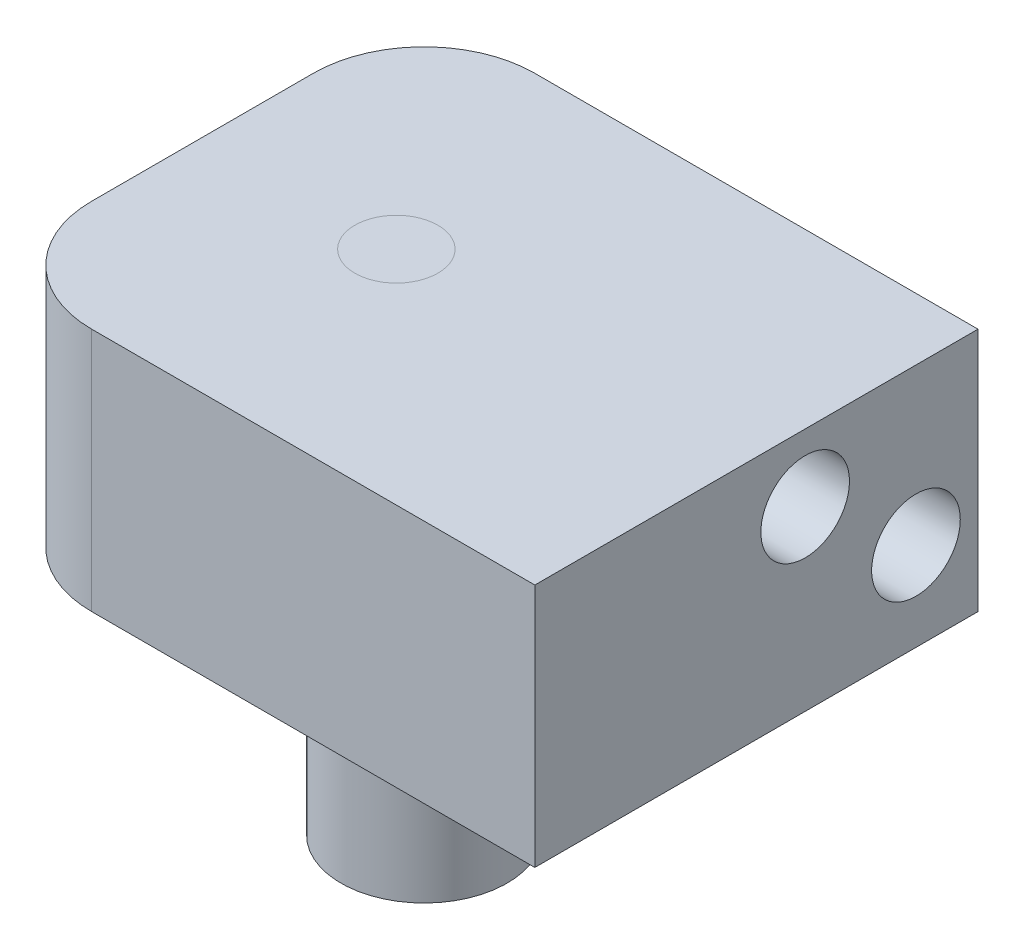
ISO-10303-21;
HEADER;
FILE_DESCRIPTION(('STEP AP214'),'2;1');
FILE_NAME('part.step','',(''),(''),'','','');
FILE_SCHEMA(('AUTOMOTIVE_DESIGN { 1 0 10303 214 1 1 1 1 }'));
ENDSEC;
DATA;
#1=APPLICATION_CONTEXT('core data for automotive mechanical design processes');
#2=APPLICATION_PROTOCOL_DEFINITION('international standard','automotive_design',2000,#1);
#3=PRODUCT_CONTEXT('',#1,'mechanical');
#4=PRODUCT('Part','Part','',(#3));
#5=PRODUCT_RELATED_PRODUCT_CATEGORY('part','',(#4));
#6=PRODUCT_DEFINITION_FORMATION('','',#4);
#7=PRODUCT_DEFINITION_CONTEXT('part definition',#1,'design');
#8=PRODUCT_DEFINITION('design','',#6,#7);
#9=PRODUCT_DEFINITION_SHAPE('','',#8);
#10=(LENGTH_UNIT() NAMED_UNIT(*) SI_UNIT(.MILLI.,.METRE.));
#11=(NAMED_UNIT(*) PLANE_ANGLE_UNIT() SI_UNIT($,.RADIAN.));
#12=(NAMED_UNIT(*) SI_UNIT($,.STERADIAN.) SOLID_ANGLE_UNIT());
#13=UNCERTAINTY_MEASURE_WITH_UNIT(LENGTH_MEASURE(1.E-05),#10,'distance_accuracy_value','');
#14=(GEOMETRIC_REPRESENTATION_CONTEXT(3) GLOBAL_UNCERTAINTY_ASSIGNED_CONTEXT((#13)) GLOBAL_UNIT_ASSIGNED_CONTEXT((#10,
#11,#12)) REPRESENTATION_CONTEXT('',''));
#15=CARTESIAN_POINT('',(0.,0.,0.));
#16=DIRECTION('',(0.,0.,1.));
#17=DIRECTION('',(1.,0.,0.));
#18=AXIS2_PLACEMENT_3D('',#15,#16,#17);
#19=CARTESIAN_POINT('',(0.,14.0208,25.4));
#20=DIRECTION('',(0.,-1.,0.));
#21=DIRECTION('',(0.,0.,-1.));
#22=AXIS2_PLACEMENT_3D('',#19,#20,#21);
#23=PLANE('',#22);
#24=DIRECTION('',(0.,0.,-1.));
#25=VECTOR('',#24,1.);
#26=CARTESIAN_POINT('',(0.,14.0208,25.4));
#27=LINE('',#26,#25);
#28=CARTESIAN_POINT('',(0.,14.0208,19.05));
#29=VERTEX_POINT('',#28);
#30=CARTESIAN_POINT('',(0.,14.0208,6.35));
#31=VERTEX_POINT('',#30);
#32=EDGE_CURVE('E121',#29,#31,#27,.T.);
#33=ORIENTED_EDGE('',*,*,#32,.F.);
#34=CARTESIAN_POINT('',(6.35,14.0208,19.05));
#35=DIRECTION('',(0.,-1.,0.));
#36=DIRECTION('',(0.,0.,-1.));
#37=AXIS2_PLACEMENT_3D('',#34,#35,#36);
#38=CIRCLE('',#37,6.35);
#39=CARTESIAN_POINT('',(6.35,14.0208,25.4));
#40=VERTEX_POINT('',#39);
#41=EDGE_CURVE('E148',#29,#40,#38,.F.);
#42=ORIENTED_EDGE('',*,*,#41,.T.);
#43=DIRECTION('',(-1.,0.,0.));
#44=VECTOR('',#43,1.);
#45=CARTESIAN_POINT('',(0.,14.0208,25.4));
#46=LINE('',#45,#44);
#47=CARTESIAN_POINT('',(31.75,14.0208,25.4));
#48=VERTEX_POINT('',#47);
#49=EDGE_CURVE('E119',#48,#40,#46,.T.);
#50=ORIENTED_EDGE('',*,*,#49,.F.);
#51=DIRECTION('',(0.,0.,-1.));
#52=VECTOR('',#51,1.);
#53=CARTESIAN_POINT('',(31.75,14.0208,25.4));
#54=LINE('',#53,#52);
#55=CARTESIAN_POINT('',(31.75,14.0208,0.));
#56=VERTEX_POINT('',#55);
#57=EDGE_CURVE('E114',#48,#56,#54,.T.);
#58=ORIENTED_EDGE('',*,*,#57,.T.);
#59=DIRECTION('',(-1.,0.,0.));
#60=VECTOR('',#59,1.);
#61=CARTESIAN_POINT('',(0.,14.0208,0.));
#62=LINE('',#61,#60);
#63=CARTESIAN_POINT('',(6.35,14.0208,0.));
#64=VERTEX_POINT('',#63);
#65=EDGE_CURVE('E104',#56,#64,#62,.T.);
#66=ORIENTED_EDGE('',*,*,#65,.T.);
#67=CARTESIAN_POINT('',(6.35,14.0208,6.35));
#68=DIRECTION('',(0.,-1.,0.));
#69=DIRECTION('',(0.,0.,-1.));
#70=AXIS2_PLACEMENT_3D('',#67,#68,#69);
#71=CIRCLE('',#70,6.35);
#72=EDGE_CURVE('E60',#64,#31,#71,.F.);
#73=ORIENTED_EDGE('',*,*,#72,.T.);
#74=EDGE_LOOP('',(#33,#42,#50,#58,#66,#73));
#75=FACE_BOUND('',#74,.T.);
#76=CARTESIAN_POINT('',(11.1125,14.0208,12.7));
#77=DIRECTION('',(0.,-1.,0.));
#78=DIRECTION('',(0.,0.,-1.));
#79=AXIS2_PLACEMENT_3D('',#76,#77,#78);
#80=CIRCLE('',#79,2.38125);
#81=CARTESIAN_POINT('',(11.1125,14.0208,10.31875));
#82=VERTEX_POINT('',#81);
#83=EDGE_CURVE('E11',#82,#82,#80,.F.);
#84=ORIENTED_EDGE('',*,*,#83,.F.);
#85=EDGE_LOOP('',(#84));
#86=FACE_BOUND('',#85,.T.);
#87=ADVANCED_FACE('F38',(#75,#86),#23,.F.);
#88=CARTESIAN_POINT('',(12.7,-1.27,12.7));
#89=DIRECTION('',(0.,-1.,0.));
#90=DIRECTION('',(0.,0.,-1.));
#91=AXIS2_PLACEMENT_3D('',#88,#89,#90);
#92=PLANE('',#91);
#93=CARTESIAN_POINT('',(12.7,-1.27,12.7));
#94=DIRECTION('',(0.,-1.,0.));
#95=DIRECTION('',(0.,0.,-1.));
#96=AXIS2_PLACEMENT_3D('',#93,#94,#95);
#97=CIRCLE('',#96,8.255);
#98=CARTESIAN_POINT('',(12.7,-1.27,4.445));
#99=VERTEX_POINT('',#98);
#100=EDGE_CURVE('E127',#99,#99,#97,.T.);
#101=ORIENTED_EDGE('',*,*,#100,.T.);
#102=EDGE_LOOP('',(#101));
#103=FACE_BOUND('',#102,.T.);
#104=CARTESIAN_POINT('',(12.7,-1.27,12.7));
#105=DIRECTION('',(0.,-1.,0.));
#106=DIRECTION('',(0.,0.,-1.));
#107=AXIS2_PLACEMENT_3D('',#104,#105,#106);
#108=CIRCLE('',#107,4.7625);
#109=CARTESIAN_POINT('',(12.7,-1.27,7.9375));
#110=VERTEX_POINT('',#109);
#111=EDGE_CURVE('E241',#110,#110,#108,.T.);
#112=ORIENTED_EDGE('',*,*,#111,.F.);
#113=EDGE_LOOP('',(#112));
#114=FACE_BOUND('',#113,.T.);
#115=ADVANCED_FACE('F174',(#103,#114),#92,.T.);
#116=CARTESIAN_POINT('',(0.,0.,25.4));
#117=DIRECTION('',(0.,1.,0.));
#118=DIRECTION('',(0.,0.,1.));
#119=AXIS2_PLACEMENT_3D('',#116,#117,#118);
#120=PLANE('',#119);
#121=DIRECTION('',(1.,0.,0.));
#122=VECTOR('',#121,1.);
#123=CARTESIAN_POINT('',(0.,0.,25.4));
#124=LINE('',#123,#122);
#125=CARTESIAN_POINT('',(6.35,0.,25.4));
#126=VERTEX_POINT('',#125);
#127=CARTESIAN_POINT('',(31.75,0.,25.4));
#128=VERTEX_POINT('',#127);
#129=EDGE_CURVE('E94',#126,#128,#124,.T.);
#130=ORIENTED_EDGE('',*,*,#129,.F.);
#131=CARTESIAN_POINT('',(6.35,0.,19.05));
#132=DIRECTION('',(0.,1.,0.));
#133=DIRECTION('',(0.,0.,1.));
#134=AXIS2_PLACEMENT_3D('',#131,#132,#133);
#135=CIRCLE('',#134,6.35);
#136=CARTESIAN_POINT('',(0.,0.,19.05));
#137=VERTEX_POINT('',#136);
#138=EDGE_CURVE('E140',#126,#137,#135,.F.);
#139=ORIENTED_EDGE('',*,*,#138,.T.);
#140=DIRECTION('',(0.,0.,-1.));
#141=VECTOR('',#140,1.);
#142=CARTESIAN_POINT('',(0.,0.,25.4));
#143=LINE('',#142,#141);
#144=CARTESIAN_POINT('',(0.,0.,6.35));
#145=VERTEX_POINT('',#144);
#146=EDGE_CURVE('E113',#137,#145,#143,.T.);
#147=ORIENTED_EDGE('',*,*,#146,.T.);
#148=CARTESIAN_POINT('',(6.35,0.,6.35));
#149=DIRECTION('',(0.,1.,0.));
#150=DIRECTION('',(0.,0.,1.));
#151=AXIS2_PLACEMENT_3D('',#148,#149,#150);
#152=CIRCLE('',#151,6.35);
#153=CARTESIAN_POINT('',(6.35,0.,0.));
#154=VERTEX_POINT('',#153);
#155=EDGE_CURVE('E138',#145,#154,#152,.F.);
#156=ORIENTED_EDGE('',*,*,#155,.T.);
#157=DIRECTION('',(1.,0.,0.));
#158=VECTOR('',#157,1.);
#159=CARTESIAN_POINT('',(0.,0.,0.));
#160=LINE('',#159,#158);
#161=CARTESIAN_POINT('',(31.75,0.,0.));
#162=VERTEX_POINT('',#161);
#163=EDGE_CURVE('E110',#154,#162,#160,.T.);
#164=ORIENTED_EDGE('',*,*,#163,.T.);
#165=DIRECTION('',(0.,0.,-1.));
#166=VECTOR('',#165,1.);
#167=CARTESIAN_POINT('',(31.75,0.,25.4));
#168=LINE('',#167,#166);
#169=EDGE_CURVE('E107',#128,#162,#168,.T.);
#170=ORIENTED_EDGE('',*,*,#169,.F.);
#171=EDGE_LOOP('',(#130,#139,#147,#156,#164,#170));
#172=FACE_BOUND('',#171,.T.);
#173=CARTESIAN_POINT('',(12.7,0.,12.7));
#174=DIRECTION('',(0.,1.,0.));
#175=DIRECTION('',(0.,0.,1.));
#176=AXIS2_PLACEMENT_3D('',#173,#174,#175);
#177=CIRCLE('',#176,8.255);
#178=CARTESIAN_POINT('',(12.7,0.,20.955));
#179=VERTEX_POINT('',#178);
#180=EDGE_CURVE('E134',#179,#179,#177,.F.);
#181=ORIENTED_EDGE('',*,*,#180,.F.);
#182=EDGE_LOOP('',(#181));
#183=FACE_BOUND('',#182,.T.);
#184=ADVANCED_FACE('F108',(#172,#183),#120,.F.);
#185=CARTESIAN_POINT('',(0.,0.,25.4));
#186=DIRECTION('',(1.,0.,0.));
#187=DIRECTION('',(0.,0.,-1.));
#188=AXIS2_PLACEMENT_3D('',#185,#186,#187);
#189=PLANE('',#188);
#190=ORIENTED_EDGE('',*,*,#146,.F.);
#191=DIRECTION('',(0.,-1.,0.));
#192=VECTOR('',#191,1.);
#193=CARTESIAN_POINT('',(0.,0.,19.05));
#194=LINE('',#193,#192);
#195=EDGE_CURVE('E145',#137,#29,#194,.F.);
#196=ORIENTED_EDGE('',*,*,#195,.T.);
#197=ORIENTED_EDGE('',*,*,#32,.T.);
#198=DIRECTION('',(0.,-1.,0.));
#199=VECTOR('',#198,1.);
#200=CARTESIAN_POINT('',(0.,0.,6.35));
#201=LINE('',#200,#199);
#202=EDGE_CURVE('E142',#31,#145,#201,.T.);
#203=ORIENTED_EDGE('',*,*,#202,.T.);
#204=EDGE_LOOP('',(#190,#196,#197,#203));
#205=FACE_BOUND('',#204,.T.);
#206=ADVANCED_FACE('F156',(#205),#189,.F.);
#207=CARTESIAN_POINT('',(31.75,0.,25.4));
#208=DIRECTION('',(-1.,0.,0.));
#209=DIRECTION('',(0.,0.,1.));
#210=AXIS2_PLACEMENT_3D('',#207,#208,#209);
#211=PLANE('',#210);
#212=CARTESIAN_POINT('',(31.75,5.08,3.556));
#213=DIRECTION('',(1.,0.,0.));
#214=DIRECTION('',(0.,0.,-1.));
#215=AXIS2_PLACEMENT_3D('',#212,#213,#214);
#216=CIRCLE('',#215,2.54);
#217=CARTESIAN_POINT('',(31.75,5.08,1.01599999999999));
#218=VERTEX_POINT('',#217);
#219=EDGE_CURVE('E232',#218,#218,#216,.T.);
#220=ORIENTED_EDGE('',*,*,#219,.F.);
#221=EDGE_LOOP('',(#220));
#222=FACE_BOUND('',#221,.T.);
#223=CARTESIAN_POINT('',(31.75,10.16,9.906));
#224=DIRECTION('',(1.,0.,0.));
#225=DIRECTION('',(0.,0.,-1.));
#226=AXIS2_PLACEMENT_3D('',#223,#224,#225);
#227=CIRCLE('',#226,2.54);
#228=CARTESIAN_POINT('',(31.75,10.16,7.36599999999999));
#229=VERTEX_POINT('',#228);
#230=EDGE_CURVE('E231',#229,#229,#227,.T.);
#231=ORIENTED_EDGE('',*,*,#230,.F.);
#232=EDGE_LOOP('',(#231));
#233=FACE_BOUND('',#232,.T.);
#234=DIRECTION('',(0.,1.,0.));
#235=VECTOR('',#234,1.);
#236=CARTESIAN_POINT('',(31.75,0.,0.));
#237=LINE('',#236,#235);
#238=EDGE_CURVE('E126',#162,#56,#237,.T.);
#239=ORIENTED_EDGE('',*,*,#238,.T.);
#240=ORIENTED_EDGE('',*,*,#57,.F.);
#241=DIRECTION('',(0.,1.,0.));
#242=VECTOR('',#241,1.);
#243=CARTESIAN_POINT('',(31.75,0.,25.4));
#244=LINE('',#243,#242);
#245=EDGE_CURVE('E99',#128,#48,#244,.T.);
#246=ORIENTED_EDGE('',*,*,#245,.F.);
#247=ORIENTED_EDGE('',*,*,#169,.T.);
#248=EDGE_LOOP('',(#239,#240,#246,#247));
#249=FACE_BOUND('',#248,.T.);
#250=ADVANCED_FACE('F116',(#222,#233,#249),#211,.F.);
#251=ORIENTED_EDGE('',*,*,#83,.T.);
#252=EDGE_LOOP('',(#251));
#253=FACE_BOUND('',#252,.T.);
#254=ADVANCED_FACE('F170',(#253),#23,.F.);
#255=CARTESIAN_POINT('',(0.,14.0208,25.4));
#256=DIRECTION('',(0.,0.,-1.));
#257=DIRECTION('',(-1.,0.,0.));
#258=AXIS2_PLACEMENT_3D('',#255,#256,#257);
#259=PLANE('',#258);
#260=ORIENTED_EDGE('',*,*,#49,.T.);
#261=DIRECTION('',(0.,-1.,0.));
#262=VECTOR('',#261,1.);
#263=CARTESIAN_POINT('',(6.35,14.0208,25.4));
#264=LINE('',#263,#262);
#265=EDGE_CURVE('E102',#40,#126,#264,.T.);
#266=ORIENTED_EDGE('',*,*,#265,.T.);
#267=ORIENTED_EDGE('',*,*,#129,.T.);
#268=ORIENTED_EDGE('',*,*,#245,.T.);
#269=EDGE_LOOP('',(#260,#266,#267,#268));
#270=FACE_BOUND('',#269,.T.);
#271=ADVANCED_FACE('F97',(#270),#259,.F.);
#272=CARTESIAN_POINT('',(0.,14.0208,0.));
#273=DIRECTION('',(0.,0.,-1.));
#274=DIRECTION('',(-1.,0.,0.));
#275=AXIS2_PLACEMENT_3D('',#272,#273,#274);
#276=PLANE('',#275);
#277=ORIENTED_EDGE('',*,*,#163,.F.);
#278=DIRECTION('',(0.,-1.,0.));
#279=VECTOR('',#278,1.);
#280=CARTESIAN_POINT('',(6.35,14.0208,0.));
#281=LINE('',#280,#279);
#282=EDGE_CURVE('E47',#154,#64,#281,.F.);
#283=ORIENTED_EDGE('',*,*,#282,.T.);
#284=ORIENTED_EDGE('',*,*,#65,.F.);
#285=ORIENTED_EDGE('',*,*,#238,.F.);
#286=EDGE_LOOP('',(#277,#283,#284,#285));
#287=FACE_BOUND('',#286,.T.);
#288=ADVANCED_FACE('F159',(#287),#276,.T.);
#289=CARTESIAN_POINT('',(12.7,-1.27,12.7));
#290=DIRECTION('',(0.,1.,0.));
#291=DIRECTION('',(0.,0.,1.));
#292=AXIS2_PLACEMENT_3D('',#289,#290,#291);
#293=CYLINDRICAL_SURFACE('',#292,8.255);
#294=ORIENTED_EDGE('',*,*,#100,.F.);
#295=EDGE_LOOP('',(#294));
#296=FACE_BOUND('',#295,.T.);
#297=ORIENTED_EDGE('',*,*,#180,.T.);
#298=EDGE_LOOP('',(#297));
#299=FACE_BOUND('',#298,.T.);
#300=ADVANCED_FACE('F161',(#296,#299),#293,.T.);
#301=CARTESIAN_POINT('',(12.7,-14.2748,12.7));
#302=DIRECTION('',(0.,1.,0.));
#303=DIRECTION('',(0.,0.,1.));
#304=AXIS2_PLACEMENT_3D('',#301,#302,#303);
#305=CYLINDRICAL_SURFACE('',#304,4.7625);
#306=CARTESIAN_POINT('',(12.7,-14.2748,12.7));
#307=DIRECTION('',(0.,-1.,0.));
#308=DIRECTION('',(0.,0.,-1.));
#309=AXIS2_PLACEMENT_3D('',#306,#307,#308);
#310=CIRCLE('',#309,4.7625);
#311=CARTESIAN_POINT('',(12.7,-14.2748,7.9375));
#312=VERTEX_POINT('',#311);
#313=EDGE_CURVE('E243',#312,#312,#310,.T.);
#314=ORIENTED_EDGE('',*,*,#313,.F.);
#315=EDGE_LOOP('',(#314));
#316=FACE_BOUND('',#315,.T.);
#317=ORIENTED_EDGE('',*,*,#111,.T.);
#318=EDGE_LOOP('',(#317));
#319=FACE_BOUND('',#318,.T.);
#320=ADVANCED_FACE('F167',(#316,#319),#305,.T.);
#321=CARTESIAN_POINT('',(12.7,-14.2748,12.7));
#322=DIRECTION('',(0.,-1.,0.));
#323=DIRECTION('',(0.,0.,-1.));
#324=AXIS2_PLACEMENT_3D('',#321,#322,#323);
#325=PLANE('',#324);
#326=ORIENTED_EDGE('',*,*,#313,.T.);
#327=EDGE_LOOP('',(#326));
#328=FACE_BOUND('',#327,.T.);
#329=ADVANCED_FACE('F197',(#328),#325,.T.);
#330=CARTESIAN_POINT('',(6.35,14.0208,19.05));
#331=DIRECTION('',(0.,-1.,0.));
#332=DIRECTION('',(0.,0.,-1.));
#333=AXIS2_PLACEMENT_3D('',#330,#331,#332);
#334=CYLINDRICAL_SURFACE('',#333,6.35);
#335=ORIENTED_EDGE('',*,*,#41,.F.);
#336=ORIENTED_EDGE('',*,*,#195,.F.);
#337=ORIENTED_EDGE('',*,*,#138,.F.);
#338=ORIENTED_EDGE('',*,*,#265,.F.);
#339=EDGE_LOOP('',(#335,#336,#337,#338));
#340=FACE_BOUND('',#339,.T.);
#341=ADVANCED_FACE('F153',(#340),#334,.T.);
#342=CARTESIAN_POINT('',(6.35,0.,6.35));
#343=DIRECTION('',(0.,1.,0.));
#344=DIRECTION('',(0.,0.,1.));
#345=AXIS2_PLACEMENT_3D('',#342,#343,#344);
#346=CYLINDRICAL_SURFACE('',#345,6.35);
#347=ORIENTED_EDGE('',*,*,#72,.F.);
#348=ORIENTED_EDGE('',*,*,#282,.F.);
#349=ORIENTED_EDGE('',*,*,#155,.F.);
#350=ORIENTED_EDGE('',*,*,#202,.F.);
#351=EDGE_LOOP('',(#347,#348,#349,#350));
#352=FACE_BOUND('',#351,.T.);
#353=ADVANCED_FACE('F40',(#352),#346,.T.);
#354=CARTESIAN_POINT('',(21.75,10.16,9.906));
#355=DIRECTION('',(1.,0.,0.));
#356=DIRECTION('',(0.,0.,-1.));
#357=AXIS2_PLACEMENT_3D('',#354,#355,#356);
#358=CYLINDRICAL_SURFACE('',#357,2.54);
#359=CARTESIAN_POINT('',(21.75,10.16,9.906));
#360=DIRECTION('',(1.,0.,0.));
#361=DIRECTION('',(0.,0.,-1.));
#362=AXIS2_PLACEMENT_3D('',#359,#360,#361);
#363=CIRCLE('',#362,2.54);
#364=CARTESIAN_POINT('',(21.75,10.16,7.36599999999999));
#365=VERTEX_POINT('',#364);
#366=EDGE_CURVE('E235',#365,#365,#363,.T.);
#367=ORIENTED_EDGE('',*,*,#366,.F.);
#368=EDGE_LOOP('',(#367));
#369=FACE_BOUND('',#368,.T.);
#370=ORIENTED_EDGE('',*,*,#230,.T.);
#371=EDGE_LOOP('',(#370));
#372=FACE_BOUND('',#371,.T.);
#373=ADVANCED_FACE('F202',(#369,#372),#358,.F.);
#374=CARTESIAN_POINT('',(21.75,10.16,9.906));
#375=DIRECTION('',(1.,0.,0.));
#376=DIRECTION('',(0.,0.,-1.));
#377=AXIS2_PLACEMENT_3D('',#374,#375,#376);
#378=PLANE('',#377);
#379=ORIENTED_EDGE('',*,*,#366,.T.);
#380=EDGE_LOOP('',(#379));
#381=FACE_BOUND('',#380,.T.);
#382=ADVANCED_FACE('F214',(#381),#378,.T.);
#383=CARTESIAN_POINT('',(21.75,5.08,3.556));
#384=DIRECTION('',(1.,0.,0.));
#385=DIRECTION('',(0.,0.,-1.));
#386=AXIS2_PLACEMENT_3D('',#383,#384,#385);
#387=CYLINDRICAL_SURFACE('',#386,2.54);
#388=CARTESIAN_POINT('',(21.75,5.08,3.556));
#389=DIRECTION('',(1.,0.,0.));
#390=DIRECTION('',(0.,0.,-1.));
#391=AXIS2_PLACEMENT_3D('',#388,#389,#390);
#392=CIRCLE('',#391,2.54);
#393=CARTESIAN_POINT('',(21.75,5.08,1.01599999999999));
#394=VERTEX_POINT('',#393);
#395=EDGE_CURVE('E230',#394,#394,#392,.T.);
#396=ORIENTED_EDGE('',*,*,#395,.F.);
#397=EDGE_LOOP('',(#396));
#398=FACE_BOUND('',#397,.T.);
#399=ORIENTED_EDGE('',*,*,#219,.T.);
#400=EDGE_LOOP('',(#399));
#401=FACE_BOUND('',#400,.T.);
#402=ADVANCED_FACE('F218',(#398,#401),#387,.F.);
#403=CARTESIAN_POINT('',(21.75,5.08,3.556));
#404=DIRECTION('',(1.,0.,0.));
#405=DIRECTION('',(0.,0.,-1.));
#406=AXIS2_PLACEMENT_3D('',#403,#404,#405);
#407=PLANE('',#406);
#408=ORIENTED_EDGE('',*,*,#395,.T.);
#409=EDGE_LOOP('',(#408));
#410=FACE_BOUND('',#409,.T.);
#411=ADVANCED_FACE('F222',(#410),#407,.T.);
#412=CLOSED_SHELL('',(#87,#115,#184,#206,#250,#254,#271,#288,#300,#320,#329,#341,#353,#373,#382,
#402,#411));
#413=MANIFOLD_SOLID_BREP('B2',#412);
#414=ADVANCED_BREP_SHAPE_REPRESENTATION('',(#18,#413),#14);
#415=SHAPE_DEFINITION_REPRESENTATION(#9,#414);
ENDSEC;
END-ISO-10303-21;
